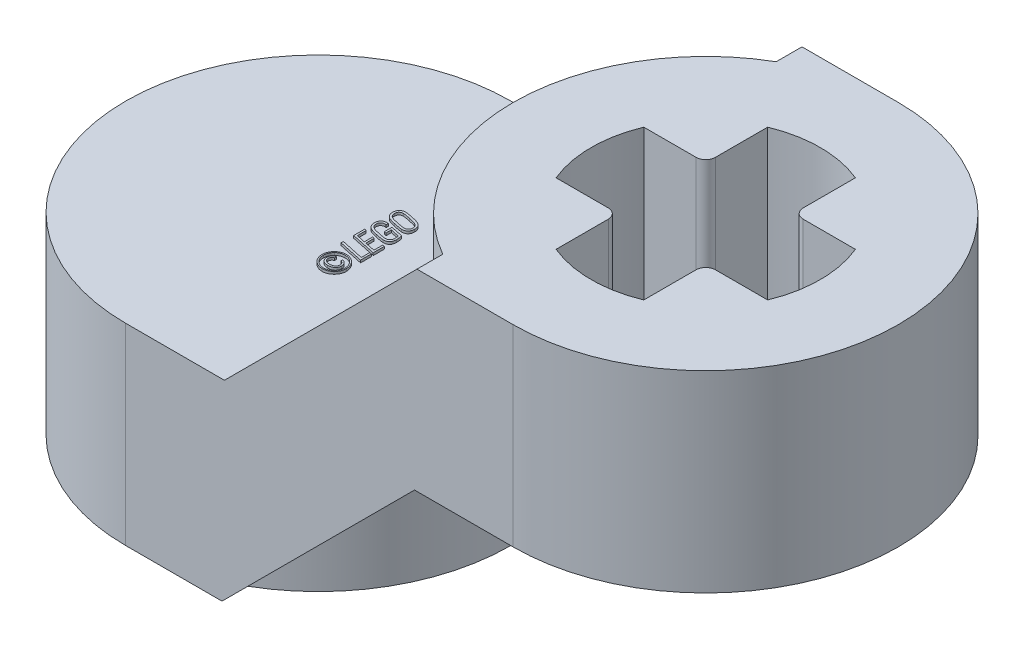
from build123d import *

# Parameters (mm, degrees)
BASE_EXTRUDE_DEPTH  = 3.95
BOSS_EXTRUDE1_DEPTH = 3.95
BOSS_EXTRUDE2_DEPTH = 3.95
BOSS_EXTRUDE4_REACH = 16.82
SKETCH6_R           = 3.95
BOSS_EXTRUDE5_DEPTH = 0.05
BOSS_EXTRUDE6_REACH = 16.82
CUT_EXTRUDE1_DEPTH  = 3.85
CUT_EXTRUDE2_DEPTH  = 3.85
FILLET1_R           = 0.2


with BuildPart() as part:
    # Sketch1 → Base-Extrude (new, symmetric)
    with BuildSketch(Plane.XY):
        Polygon((7.95, 3.95), (7.95, 7.9), (5.975, 7.9), (2.025, 3.95), (0, 3.95), (0, 0), (1.975, 0), (5.925, 3.95), align=None)
    extrude(amount=BASE_EXTRUDE_DEPTH, both=True)

    # Sketch2 → Boss-Extrude1 (add)
    with BuildSketch(Plane(origin=(0, 7.9, 0), x_dir=(-1, 0, 0), z_dir=(0, 1, 0))):
        with BuildLine():
            Line((-7.95, 3.95), (-7.95, -3.95))
            ThreePointArc((-7.95, -3.95), (-11.9, 0), (-7.95, 3.95))
        make_face()
    extrude(amount=-BOSS_EXTRUDE1_DEPTH)

    # Sketch3 → Boss-Extrude2 (add)
    with BuildSketch(Plane(origin=(0, 3.95, 0), x_dir=(-1, 0, 0), z_dir=(0, 1, 0))):
        with BuildLine():
            Line((0, 3.95), (0, -3.95))
            ThreePointArc((0, -3.95), (3.95, 0), (0, 3.95))
        make_face()
    extrude(amount=-BOSS_EXTRUDE2_DEPTH)

    # Sketch6 → Boss-Extrude4 (add, up to next)
    with BuildSketch(Plane.XZ, mode=Mode.PRIVATE) as boss_extrude4_sk1:
        Circle(SKETCH6_R)
    boss_extrude4_tool1 = extrude(boss_extrude4_sk1.sketch, amount=-BOSS_EXTRUDE4_REACH, mode=Mode.PRIVATE) - part.part
    add(boss_extrude4_tool1.solids().sort_by_distance((0, 0, 0))[0])

    # Sketch8 → Boss-Extrude5 (add)
    # profile 1 of 6: a face of its own
    with BuildSketch(Plane(origin=(3.457388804, 3.95, -0.420708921), x_dir=(0, 0, -1), z_dir=(0, 1, 0))):
        with BuildLine():
            add(Edge.make_bspline(
                [(-1.184734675, 2.616102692), (-1.176321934, 2.615850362), (-1.159629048, 2.615349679), (-1.134907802, 2.611884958), (-1.110946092, 2.605789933), (-1.08771275, 2.597576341), (-1.065439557, 2.587097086), (-1.044290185, 2.574455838), (-1.024445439, 2.559567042), (-1.01241201, 2.548157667), (-1.00635184, 2.542411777)],
                knots=[0, 0, 0, 0, 1.018957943, 2.021855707, 3.0162028, 4.009185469, 5.002380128, 5.992645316, 6.989073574, 8, 8, 8, 8], degree=3))
            add(Edge.make_bspline(
                [(-1.00635184, 2.542411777), (-1.000695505, 2.536496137), (-0.989428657, 2.52471278), (-0.974970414, 2.505055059), (-0.962403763, 2.484206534), (-0.952247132, 2.462031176), (-0.9440291, 2.438956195), (-0.938316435, 2.415066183), (-0.934554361, 2.390575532), (-0.934173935, 2.374003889), (-0.933982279, 2.365655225)],
                knots=[0, 0, 0, 0, 1.000946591, 1.993784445, 2.979555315, 3.975955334, 4.974114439, 5.972928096, 6.978776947, 8, 8, 8, 8], degree=3))
            add(Edge.make_bspline(
                [(-0.933982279, 2.365655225), (-0.934182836, 2.35720674), (-0.934578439, 2.340541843), (-0.938151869, 2.315989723), (-0.943940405, 2.292332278), (-0.95199028, 2.269576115), (-0.962264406, 2.247869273), (-0.974791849, 2.227349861), (-0.989287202, 2.207836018), (-1.000624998, 2.1961319), (-1.00635184, 2.190220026)],
                knots=[0, 0, 0, 0, 1.039328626, 2.050107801, 3.04630548, 4.032829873, 5.015822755, 5.996291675, 6.987905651, 8, 8, 8, 8], degree=3))
            add(Edge.make_bspline(
                [(-1.00635184, 2.190220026), (-1.012540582, 2.18439546), (-1.024818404, 2.172840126), (-1.04515056, 2.157919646), (-1.066521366, 2.144940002), (-1.088983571, 2.134162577), (-1.112241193, 2.125711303), (-1.136051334, 2.119740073), (-1.160249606, 2.115896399), (-1.176555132, 2.115437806), (-1.184734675, 2.115207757)],
                knots=[0, 0, 0, 0, 1.026834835, 2.037133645, 3.042569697, 4.046736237, 5.044640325, 6.02933777, 7.011432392, 8, 8, 8, 8], degree=3))
            add(Edge.make_bspline(
                [(-1.184734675, 2.115207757), (-1.192946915, 2.115446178), (-1.209278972, 2.115920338), (-1.233451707, 2.119610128), (-1.257099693, 2.125488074), (-1.28002556, 2.133865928), (-1.302150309, 2.144383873), (-1.323012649, 2.157354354), (-1.342971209, 2.172158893), (-1.355000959, 2.183681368), (-1.361084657, 2.189508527)],
                knots=[0, 0, 0, 0, 1.00281557, 1.994345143, 2.98007901, 3.975109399, 4.971043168, 5.966942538, 6.971839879, 8, 8, 8, 8], degree=3))
            add(Edge.make_bspline(
                [(-1.361084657, 2.189508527), (-1.366876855, 2.195524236), (-1.378379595, 2.207470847), (-1.393136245, 2.227304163), (-1.405891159, 2.248219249), (-1.416435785, 2.270209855), (-1.42469643, 2.293168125), (-1.430602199, 2.316794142), (-1.43413683, 2.341052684), (-1.434629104, 2.357410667), (-1.434877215, 2.365655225)],
                knots=[0, 0, 0, 0, 1.021116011, 2.02783661, 3.017680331, 4.015421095, 5.006948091, 5.998492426, 6.991223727, 8, 8, 8, 8], degree=3))
            add(Edge.make_bspline(
                [(-1.434877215, 2.365655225), (-1.434634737, 2.37386667), (-1.434151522, 2.390230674), (-1.430504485, 2.41448871), (-1.424467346, 2.438251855), (-1.416013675, 2.461387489), (-1.405339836, 2.483738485), (-1.392560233, 2.505078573), (-1.377752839, 2.525363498), (-1.366264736, 2.537644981), (-1.360474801, 2.543834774)],
                knots=[0, 0, 0, 0, 0.994980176, 1.982825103, 2.965844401, 3.962221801, 4.963259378, 5.963294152, 6.973512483, 8, 8, 8, 8], degree=3))
            add(Edge.make_bspline(
                [(-1.360474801, 2.543834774), (-1.354585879, 2.549480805), (-1.34289658, 2.560687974), (-1.323524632, 2.575252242), (-1.302899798, 2.587745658), (-1.280991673, 2.597966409), (-1.258107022, 2.60615923), (-1.234327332, 2.611914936), (-1.209781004, 2.615505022), (-1.193149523, 2.615901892), (-1.184734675, 2.616102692)],
                knots=[0, 0, 0, 0, 1.00234497, 1.989618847, 2.972647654, 3.96216877, 4.956928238, 5.956152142, 6.965896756, 8, 8, 8, 8], degree=3))
        make_face()
        with BuildLine():
            add(Edge.make_bspline(
                [(-0.960002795, 2.365451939), (-0.960188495, 2.372916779), (-0.960557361, 2.387744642), (-0.963812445, 2.409677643), (-0.969113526, 2.43101231), (-0.976450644, 2.451668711), (-0.985689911, 2.471487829), (-0.996789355, 2.490292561), (-1.009875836, 2.507886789), (-1.019835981, 2.518613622), (-1.0248508, 2.524014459)],
                knots=[0, 0, 0, 0, 1.018933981, 2.023970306, 3.020439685, 4.01699499, 5.012615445, 6.002099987, 6.994080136, 8, 8, 8, 8], degree=3))
            add(Edge.make_bspline(
                [(-1.0248508, 2.524014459), (-1.03029877, 2.529223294), (-1.041090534, 2.539541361), (-1.059111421, 2.552720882), (-1.07800116, 2.564209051), (-1.098016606, 2.573512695), (-1.118747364, 2.580998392), (-1.140207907, 2.586264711), (-1.162272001, 2.589534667), (-1.177201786, 2.589898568), (-1.184734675, 2.590082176)],
                knots=[0, 0, 0, 0, 1.017557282, 2.015657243, 3.00970618, 4.001009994, 4.993000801, 5.983500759, 6.982566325, 8, 8, 8, 8], degree=3))
            add(Edge.make_bspline(
                [(-1.184734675, 2.590082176), (-1.192199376, 2.589895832), (-1.207026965, 2.589525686), (-1.228929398, 2.5862849), (-1.25019447, 2.580968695), (-1.270721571, 2.573649), (-1.290357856, 2.564428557), (-1.308841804, 2.553240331), (-1.326278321, 2.540376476), (-1.33672497, 2.530366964), (-1.341975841, 2.525335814)],
                knots=[0, 0, 0, 0, 1.025734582, 2.03747875, 3.036079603, 4.034897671, 5.028729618, 6.012822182, 7.001171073, 8, 8, 8, 8], degree=3))
            add(Edge.make_bspline(
                [(-1.341975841, 2.525335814), (-1.347162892, 2.519733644), (-1.357435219, 2.508639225), (-1.370917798, 2.490512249), (-1.382443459, 2.471338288), (-1.391994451, 2.451211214), (-1.399500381, 2.430407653), (-1.404968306, 2.409116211), (-1.408157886, 2.387401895), (-1.408623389, 2.372780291), (-1.408856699, 2.365451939)],
                knots=[0, 0, 0, 0, 1.030362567, 2.040508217, 3.044001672, 4.046733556, 5.043824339, 6.025813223, 7.010537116, 8, 8, 8, 8], degree=3))
            add(Edge.make_bspline(
                [(-1.408856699, 2.365451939), (-1.40862645, 2.358123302), (-1.408169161, 2.343568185), (-1.404960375, 2.321956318), (-1.399493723, 2.30084785), (-1.392118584, 2.280226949), (-1.382673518, 2.260391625), (-1.371204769, 2.241641), (-1.357974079, 2.223891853), (-1.347812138, 2.213129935), (-1.342687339, 2.20770256)],
                knots=[0, 0, 0, 0, 1.001897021, 1.989828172, 2.979668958, 3.97900318, 4.979796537, 5.977647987, 6.980101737, 8, 8, 8, 8], degree=3))
            add(Edge.make_bspline(
                [(-1.342687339, 2.20770256), (-1.337257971, 2.202580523), (-1.326457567, 2.192391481), (-1.308694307, 2.179097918), (-1.289871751, 2.167630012), (-1.270067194, 2.15807094), (-1.249459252, 2.150571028), (-1.228297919, 2.145118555), (-1.206651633, 2.141921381), (-1.192063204, 2.141460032), (-1.184734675, 2.141228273)],
                knots=[0, 0, 0, 0, 1.018033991, 2.025130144, 3.021157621, 4.022120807, 5.021202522, 6.009233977, 6.999934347, 8, 8, 8, 8], degree=3))
            add(Edge.make_bspline(
                [(-1.184734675, 2.141228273), (-1.177404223, 2.141448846), (-1.162773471, 2.141889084), (-1.141053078, 2.145275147), (-1.119683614, 2.150631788), (-1.098848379, 2.158328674), (-1.0786867, 2.167927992), (-1.059476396, 2.179477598), (-1.04136013, 2.192897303), (-1.030378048, 2.20321912), (-1.0248508, 2.208414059)],
                knots=[0, 0, 0, 0, 0.988726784, 1.973386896, 2.95907585, 3.956986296, 4.965064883, 5.967811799, 6.977205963, 8, 8, 8, 8], degree=3))
            add(Edge.make_bspline(
                [(-1.0248508, 2.208414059), (-1.019743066, 2.213691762), (-1.009596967, 2.22417549), (-0.996719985, 2.24173004), (-0.98530942, 2.260071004), (-0.976274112, 2.279654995), (-0.968963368, 2.30004759), (-0.963845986, 2.321242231), (-0.96053819, 2.343121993), (-0.960182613, 2.357952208), (-0.960002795, 2.365451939)],
                knots=[0, 0, 0, 0, 1.008934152, 2.004165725, 2.987050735, 3.975046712, 4.963888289, 5.961734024, 6.969236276, 8, 8, 8, 8], degree=3))
        make_face(mode=Mode.SUBTRACT)
    # profile 2 of 6: a face of its own
    with BuildSketch(Plane(origin=(3.457388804, 3.95, -0.420708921), x_dir=(0, 0, -1), z_dir=(0, 1, 0))):
        with BuildLine():
            add(Edge.make_bspline(
                [(-1.116125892, 2.429791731), (-1.117333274, 2.434015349), (-1.119688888, 2.442255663), (-1.125630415, 2.45341847), (-1.13303663, 2.463229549), (-1.142172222, 2.47133904), (-1.152618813, 2.477947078), (-1.164403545, 2.482616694), (-1.177341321, 2.48554819), (-1.186378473, 2.485846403), (-1.191036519, 2.486000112)],
                knots=[0, 0, 0, 0, 1.034583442, 2.018481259, 2.965600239, 3.922832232, 4.88602793, 5.869340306, 6.901787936, 8, 8, 8, 8], degree=3))
            add(Edge.make_bspline(
                [(-1.191036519, 2.486000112), (-1.194397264, 2.485908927), (-1.20098528, 2.485730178), (-1.210555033, 2.484142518), (-1.219581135, 2.481745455), (-1.228042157, 2.478257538), (-1.235859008, 2.473643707), (-1.243128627, 2.468119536), (-1.249835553, 2.461617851), (-1.255867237, 2.454118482), (-1.261276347, 2.445734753), (-1.2659551, 2.436532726), (-1.269914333, 2.426523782), (-1.273157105, 2.415707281), (-1.275673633, 2.40408308), (-1.277517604, 2.391658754), (-1.278478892, 2.378409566), (-1.278660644, 2.369315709), (-1.278754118, 2.364638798)],
                knots=[0, 0, 0, 0, 0.954364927, 1.870826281, 2.749014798, 3.603666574, 4.462321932, 5.321139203, 6.192652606, 7.109872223, 8.049900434, 9.023020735, 10.038511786, 11.104546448, 12.228195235, 13.415499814, 14.67080855, 16, 16, 16, 16], degree=3))
            add(Edge.make_bspline(
                [(-1.278754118, 2.364638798), (-1.278670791, 2.36016428), (-1.278508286, 2.351438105), (-1.277398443, 2.338699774), (-1.27549472, 2.326665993), (-1.272730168, 2.315360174), (-1.269301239, 2.304730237), (-1.265061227, 2.294830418), (-1.259883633, 2.28573561), (-1.254175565, 2.277280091), (-1.247655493, 2.269781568), (-1.240610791, 2.263179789), (-1.232944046, 2.25766957), (-1.224707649, 2.253165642), (-1.215968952, 2.249551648), (-1.206584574, 2.247175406), (-1.196715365, 2.245578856), (-1.18992505, 2.245401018), (-1.1864626, 2.245310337)],
                knots=[0, 0, 0, 0, 1.263666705, 2.46439412, 3.608060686, 4.701172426, 5.748162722, 6.759612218, 7.736430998, 8.699894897, 9.636077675, 10.536616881, 11.420945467, 12.294596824, 13.183057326, 14.083596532, 15.022806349, 16, 16, 16, 16], degree=3))
            add(Edge.make_bspline(
                [(-1.1864626, 2.245310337), (-1.181365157, 2.245532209), (-1.171440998, 2.24596417), (-1.157108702, 2.24912009), (-1.143977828, 2.254638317), (-1.132085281, 2.262118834), (-1.121788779, 2.271507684), (-1.113329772, 2.282416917), (-1.106844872, 2.29480689), (-1.104374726, 2.303830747), (-1.103115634, 2.308430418)],
                knots=[0, 0, 0, 0, 1.079119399, 2.10092667, 3.088298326, 4.081569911, 5.061799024, 6.023337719, 6.992448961, 8, 8, 8, 8], degree=3))
            Line((-1.103115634, 2.308430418), (-1.070589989, 2.308430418))
            add(Edge.make_bspline(
                [(-1.070589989, 2.308430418), (-1.070993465, 2.304996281), (-1.071791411, 2.298204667), (-1.074205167, 2.288354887), (-1.077294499, 2.278906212), (-1.081517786, 2.270032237), (-1.086651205, 2.261636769), (-1.092657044, 2.253685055), (-1.099613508, 2.246235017), (-1.107440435, 2.239369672), (-1.115881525, 2.233104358), (-1.124911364, 2.227678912), (-1.134403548, 2.223088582), (-1.144406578, 2.219319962), (-1.15491743, 2.216378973), (-1.165924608, 2.214227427), (-1.177422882, 2.213017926), (-1.185240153, 2.212863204), (-1.189206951, 2.212784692)],
                knots=[0, 0, 0, 0, 0.986260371, 1.95050462, 2.889531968, 3.819800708, 4.748761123, 5.694736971, 6.65970864, 7.65334055, 8.66317646, 9.65680837, 10.656120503, 11.66933233, 12.704332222, 13.768524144, 14.867659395, 16, 16, 16, 16], degree=3))
            add(Edge.make_bspline(
                [(-1.189206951, 2.212784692), (-1.194026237, 2.212876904), (-1.203439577, 2.213057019), (-1.217123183, 2.215188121), (-1.230028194, 2.218434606), (-1.242254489, 2.22288144), (-1.253645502, 2.228833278), (-1.264330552, 2.236009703), (-1.274234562, 2.244490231), (-1.283268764, 2.254274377), (-1.291332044, 2.265152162), (-1.298578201, 2.276877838), (-1.304408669, 2.289697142), (-1.309278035, 2.303337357), (-1.313187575, 2.317874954), (-1.315864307, 2.333319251), (-1.317540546, 2.349693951), (-1.317701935, 2.360907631), (-1.317784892, 2.366671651)],
                knots=[0, 0, 0, 0, 1.021960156, 1.996158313, 2.930921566, 3.843207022, 4.750120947, 5.651545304, 6.569508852, 7.510803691, 8.471453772, 9.439502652, 10.430355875, 11.453832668, 12.510809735, 13.620872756, 14.777088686, 16, 16, 16, 16], degree=3))
            add(Edge.make_bspline(
                [(-1.317784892, 2.366671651), (-1.31765439, 2.372299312), (-1.317399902, 2.383273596), (-1.315810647, 2.399293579), (-1.312954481, 2.414421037), (-1.30896113, 2.428683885), (-1.304051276, 2.442187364), (-1.297801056, 2.454736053), (-1.290435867, 2.466411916), (-1.28200124, 2.477150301), (-1.272712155, 2.486942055), (-1.262501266, 2.495369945), (-1.251661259, 2.502587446), (-1.24006682, 2.508381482), (-1.227787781, 2.513026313), (-1.214750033, 2.516218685), (-1.201025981, 2.518220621), (-1.191653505, 2.518422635), (-1.18686917, 2.518525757)],
                knots=[0, 0, 0, 0, 1.196898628, 2.334025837, 3.419361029, 4.466545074, 5.481092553, 6.470377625, 7.441922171, 8.411995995, 9.370087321, 10.306500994, 11.221801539, 12.13374922, 13.057210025, 14.007902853, 14.983101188, 16, 16, 16, 16], degree=3))
            add(Edge.make_bspline(
                [(-1.18686917, 2.518525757), (-1.183241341, 2.518440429), (-1.176103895, 2.518272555), (-1.165628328, 2.517166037), (-1.155563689, 2.515221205), (-1.14595003, 2.512475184), (-1.136734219, 2.509046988), (-1.128017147, 2.504698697), (-1.119709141, 2.499646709), (-1.111891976, 2.493853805), (-1.104717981, 2.487490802), (-1.098245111, 2.4806528), (-1.092618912, 2.473296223), (-1.087853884, 2.46544387), (-1.083829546, 2.457197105), (-1.080821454, 2.448438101), (-1.078417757, 2.439305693), (-1.077539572, 2.432988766), (-1.077095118, 2.429791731)],
                knots=[0, 0, 0, 0, 1.121250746, 2.205965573, 3.251297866, 4.285503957, 5.292962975, 6.285785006, 7.291501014, 8.29470614, 9.288687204, 10.251738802, 11.200508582, 12.145166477, 13.086568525, 14.030471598, 15.003209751, 16, 16, 16, 16], degree=3))
            Line((-1.077095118, 2.429791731), (-1.116125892, 2.429791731))
        make_face()
    # profile 3 of 6: a face of its own
    with BuildSketch(Plane(origin=(3.457388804, 3.95, -0.420708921), x_dir=(0, 0, -1), z_dir=(0, 1, 0))):
        Polygon((-0.888446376, 2.121712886), (-0.781416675, 2.62911295), (-0.734356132, 2.62911295), (-0.834779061, 2.16074366), (-0.66076686, 2.16074366), (-0.669101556, 2.121712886), align=None)
    # profile 4 of 6: a face of its own
    with BuildSketch(Plane(origin=(3.457388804, 3.95, -0.420708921), x_dir=(0, 0, -1), z_dir=(0, 1, 0))):
        Polygon((-0.628241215, 2.121712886), (-0.522126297, 2.62911295), (-0.296479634, 2.62911295), (-0.304509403, 2.590082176), (-0.48604316, 2.590082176), (-0.525480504, 2.407938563), (-0.355025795, 2.407938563), (-0.362648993, 2.368907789), (-0.53300206, 2.368907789), (-0.575082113, 2.16074366), (-0.394056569, 2.16074366), (-0.40137484, 2.121712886), align=None)
    # profile 5 of 6: a face of its own
    with BuildSketch(Plane(origin=(3.457388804, 3.95, -0.420708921), x_dir=(0, 0, -1), z_dir=(0, 1, 0))):
        with BuildLine():
            add(Edge.make_bspline(
                [(-0.034851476, 2.130860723), (-0.040879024, 2.129657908), (-0.052615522, 2.127315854), (-0.069797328, 2.124179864), (-0.086082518, 2.121381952), (-0.101471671, 2.119166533), (-0.115939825, 2.117394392), (-0.129468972, 2.116222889), (-0.142037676, 2.115288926), (-0.150112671, 2.115234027), (-0.153976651, 2.115207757)],
                knots=[0, 0, 0, 0, 1.225832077, 2.386870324, 3.483325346, 4.521138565, 5.487527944, 6.389900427, 7.229548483, 8, 8, 8, 8], degree=3))
            add(Edge.make_bspline(
                [(-0.153976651, 2.115207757), (-0.159672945, 2.115290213), (-0.170751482, 2.11545058), (-0.186818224, 2.117121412), (-0.201809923, 2.119723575), (-0.215748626, 2.123352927), (-0.228577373, 2.12813918), (-0.240387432, 2.133908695), (-0.251020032, 2.14090356), (-0.260644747, 2.148837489), (-0.2691449, 2.157853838), (-0.276500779, 2.167896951), (-0.282757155, 2.178932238), (-0.2876928, 2.191058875), (-0.291659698, 2.204084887), (-0.294526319, 2.21813327), (-0.296092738, 2.233179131), (-0.296348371, 2.243545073), (-0.296479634, 2.24886783)],
                knots=[0, 0, 0, 0, 1.222313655, 2.377238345, 3.462882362, 4.486000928, 5.464004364, 6.397432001, 7.301091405, 8.189403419, 9.069130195, 9.953503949, 10.85555242, 11.784749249, 12.757873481, 13.774795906, 14.85739087, 16, 16, 16, 16], degree=3))
            add(Edge.make_bspline(
                [(-0.296479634, 2.24886783), (-0.296380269, 2.252867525), (-0.296163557, 2.261590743), (-0.294975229, 2.275698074), (-0.293013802, 2.29193216), (-0.29071912, 2.306780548), (-0.288652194, 2.319899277), (-0.286647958, 2.330716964), (-0.284702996, 2.342332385), (-0.282272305, 2.354601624), (-0.279903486, 2.367672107), (-0.277117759, 2.38144744), (-0.2741847, 2.395985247), (-0.272124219, 2.40590671), (-0.271068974, 2.410987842)],
                knots=[0, 0, 0, 0, 0.876487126, 1.911592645, 3.100341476, 4.458879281, 5.203351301, 6.010101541, 6.869316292, 7.783654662, 8.750433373, 9.779746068, 10.862929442, 12, 12, 12, 12], degree=3))
            add(Edge.make_bspline(
                [(-0.271068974, 2.410987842), (-0.269958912, 2.416037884), (-0.267804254, 2.425840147), (-0.264524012, 2.44013192), (-0.261379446, 2.453617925), (-0.258382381, 2.466311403), (-0.255294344, 2.478118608), (-0.252338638, 2.489127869), (-0.249528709, 2.499336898), (-0.245944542, 2.511568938), (-0.241516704, 2.525349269), (-0.236043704, 2.54020831), (-0.230672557, 2.553001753), (-0.226602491, 2.560563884), (-0.224719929, 2.56406166)],
                knots=[0, 0, 0, 0, 1.160392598, 2.252352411, 3.290740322, 4.268182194, 5.179221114, 6.029501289, 6.826431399, 7.555467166, 8.890004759, 10.073631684, 11.108980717, 12, 12, 12, 12], degree=3))
            add(Edge.make_bspline(
                [(-0.224719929, 2.56406166), (-0.220817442, 2.570343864), (-0.213208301, 2.58259302), (-0.199302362, 2.598637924), (-0.184069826, 2.612240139), (-0.167260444, 2.623286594), (-0.148786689, 2.631794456), (-0.128683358, 2.637868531), (-0.106840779, 2.641458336), (-0.091751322, 2.641896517), (-0.083944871, 2.642123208)],
                knots=[0, 0, 0, 0, 1.045860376, 2.039237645, 2.994234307, 3.929665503, 4.876250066, 5.864225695, 6.895068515, 8, 8, 8, 8], degree=3))
            add(Edge.make_bspline(
                [(-0.083944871, 2.642123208), (-0.078858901, 2.642030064), (-0.068934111, 2.641848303), (-0.054487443, 2.640308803), (-0.040888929, 2.637775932), (-0.028169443, 2.634280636), (-0.016397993, 2.629622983), (-0.005410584, 2.624197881), (0.004593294, 2.617491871), (0.013764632, 2.609899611), (0.02188694, 2.601345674), (0.029004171, 2.591987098), (0.035008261, 2.581788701), (0.039912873, 2.570737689), (0.043626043, 2.558888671), (0.046405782, 2.546279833), (0.048038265, 2.532832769), (0.048206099, 2.523578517), (0.048292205, 2.518830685)],
                knots=[0, 0, 0, 0, 1.187988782, 2.318247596, 3.389450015, 4.41694543, 5.394441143, 6.343149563, 7.273990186, 8.201324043, 9.119525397, 10.023491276, 10.942545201, 11.878052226, 12.841830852, 13.83862194, 14.891119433, 16, 16, 16, 16], degree=3))
            add(Edge.make_bspline(
                [(0.048292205, 2.518830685), (0.048234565, 2.517034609), (0.048101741, 2.512895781), (0.047604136, 2.505902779), (0.046500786, 2.497378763), (0.045684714, 2.491183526), (0.045242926, 2.487829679)],
                knots=[0, 0, 0, 0, 0.691807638, 1.594182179, 2.69758897, 4, 4, 4, 4], degree=3))
            Line((0.045242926, 2.487829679), (0.045242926, 2.486000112))
            Line((0.045242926, 2.486000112), (0.000621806, 2.486000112))
            add(Edge.make_bspline(
                [(0.000621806, 2.486000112), (0.000988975, 2.488368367), (0.001684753, 2.492856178), (0.002253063, 2.499444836), (0.002723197, 2.505644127), (0.002745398, 2.509715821), (0.002756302, 2.5117157)],
                knots=[0, 0, 0, 0, 1.112961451, 2.109046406, 3.071227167, 4, 4, 4, 4], degree=3))
            add(Edge.make_bspline(
                [(0.002756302, 2.5117157), (0.002662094, 2.515240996), (0.002478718, 2.522102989), (0.001526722, 2.532079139), (-0.000346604, 2.541422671), (-0.002867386, 2.550171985), (-0.006092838, 2.558386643), (-0.010219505, 2.565893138), (-0.014883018, 2.572920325), (-0.02039648, 2.579187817), (-0.026521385, 2.584825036), (-0.033281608, 2.589720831), (-0.040621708, 2.593931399), (-0.048631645, 2.597257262), (-0.057195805, 2.599938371), (-0.066371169, 2.601699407), (-0.076122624, 2.602861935), (-0.082823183, 2.60301395), (-0.086282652, 2.603092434)],
                knots=[0, 0, 0, 0, 1.166547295, 2.270685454, 3.310422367, 4.31425725, 5.280012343, 6.222860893, 7.143051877, 8.064607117, 8.976914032, 9.89162764, 10.820312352, 11.769601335, 12.755186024, 13.783929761, 14.855852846, 16, 16, 16, 16], degree=3))
            add(Edge.make_bspline(
                [(-0.086282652, 2.603092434), (-0.091990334, 2.602918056), (-0.103092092, 2.602578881), (-0.119050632, 2.599356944), (-0.133699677, 2.594166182), (-0.147038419, 2.586845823), (-0.159151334, 2.577260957), (-0.17012769, 2.565400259), (-0.180310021, 2.551356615), (-0.185919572, 2.540795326), (-0.188840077, 2.535296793)],
                knots=[0, 0, 0, 0, 1.048026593, 2.038469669, 2.978039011, 3.894986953, 4.821840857, 5.804264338, 6.85683226, 8, 8, 8, 8], degree=3))
            add(Edge.make_bspline(
                [(-0.188840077, 2.535296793), (-0.190272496, 2.532299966), (-0.193426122, 2.525702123), (-0.197540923, 2.514505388), (-0.201943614, 2.501363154), (-0.205482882, 2.489071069), (-0.208593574, 2.478107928), (-0.210825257, 2.468778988), (-0.213427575, 2.458706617), (-0.216075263, 2.447797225), (-0.218750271, 2.436050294), (-0.221786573, 2.423550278), (-0.224657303, 2.410202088), (-0.226711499, 2.401059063), (-0.227769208, 2.396351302)],
                knots=[0, 0, 0, 0, 0.826735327, 1.820148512, 2.967388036, 4.278160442, 5.00481677, 5.804905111, 6.666383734, 7.595406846, 8.600254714, 9.666453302, 10.798452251, 12, 12, 12, 12], degree=3))
            add(Edge.make_bspline(
                [(-0.227769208, 2.396351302), (-0.228879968, 2.390962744), (-0.231025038, 2.380556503), (-0.234229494, 2.365605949), (-0.236909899, 2.351789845), (-0.239549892, 2.339218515), (-0.241579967, 2.327733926), (-0.243612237, 2.317498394), (-0.245057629, 2.308426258), (-0.246855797, 2.29826059), (-0.248351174, 2.287032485), (-0.249848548, 2.274945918), (-0.250701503, 2.264431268), (-0.250867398, 2.257949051), (-0.250943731, 2.254966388)],
                knots=[0, 0, 0, 0, 1.380724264, 2.666417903, 3.83700122, 4.912538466, 5.889783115, 6.763609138, 7.531013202, 8.194978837, 9.354142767, 10.372930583, 11.251336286, 12, 12, 12, 12], degree=3))
            add(Edge.make_bspline(
                [(-0.250943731, 2.254966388), (-0.250870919, 2.251134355), (-0.250729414, 2.243686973), (-0.249481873, 2.232841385), (-0.247470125, 2.222633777), (-0.244626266, 2.213029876), (-0.240956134, 2.204037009), (-0.236496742, 2.195664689), (-0.231151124, 2.187975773), (-0.225042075, 2.180966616), (-0.218267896, 2.174637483), (-0.210732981, 2.1692467), (-0.202738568, 2.164534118), (-0.194064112, 2.160751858), (-0.184837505, 2.15779666), (-0.174944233, 2.155828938), (-0.164519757, 2.154425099), (-0.157335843, 2.154301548), (-0.153671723, 2.154238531)],
                knots=[0, 0, 0, 0, 1.159097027, 2.25265184, 3.298060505, 4.303502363, 5.27816348, 6.232119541, 7.167667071, 8.105010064, 9.040782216, 9.96554058, 10.902659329, 11.843582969, 12.822654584, 13.827887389, 14.892124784, 16, 16, 16, 16], degree=3))
            add(Edge.make_bspline(
                [(-0.153671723, 2.154238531), (-0.146620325, 2.154351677), (-0.132831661, 2.154572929), (-0.112551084, 2.156425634), (-0.093020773, 2.159593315), (-0.080431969, 2.162943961), (-0.074187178, 2.16460608)],
                knots=[0, 0, 0, 0, 1.052006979, 2.057148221, 3.036230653, 4, 4, 4, 4], degree=3))
            Line((-0.074187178, 2.16460608), (-0.034139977, 2.342887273))
            Line((-0.034139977, 2.342887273), (-0.146861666, 2.342887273))
            Line((-0.146861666, 2.342887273), (-0.138425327, 2.381918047))
            Line((-0.138425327, 2.381918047), (0.01576656, 2.381918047))
            Line((0.01576656, 2.381918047), (-0.018995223, 2.20770256))
            add(Edge.make_bspline(
                [(-0.018995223, 2.20770256), (-0.020197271, 2.202386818), (-0.022689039, 2.191367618), (-0.02561353, 2.17719172), (-0.028005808, 2.164876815), (-0.030027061, 2.154466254), (-0.032386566, 2.143025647), (-0.034006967, 2.135028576), (-0.034851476, 2.130860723)],
                knots=[0, 0, 0, 0, 1.25022728, 2.591642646, 3.320264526, 4.128149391, 5.0244431, 6, 6, 6, 6], degree=3))
        make_face()
    # profile 6 of 6: a face of its own
    with BuildSketch(Plane(origin=(3.457388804, 3.95, -0.420708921), x_dir=(0, 0, -1), z_dir=(0, 1, 0))):
        with BuildLine():
            add(Edge.make_bspline(
                [(0.08081785, 2.246225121), (0.080907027, 2.250394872), (0.081104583, 2.259632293), (0.08254738, 2.274720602), (0.084839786, 2.292366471), (0.087912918, 2.312560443), (0.091753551, 2.335342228), (0.096645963, 2.360578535), (0.101920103, 2.388370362), (0.10602037, 2.407641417), (0.108159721, 2.417696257)],
                knots=[0, 0, 0, 0, 0.575618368, 1.2751913, 2.090889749, 3.032200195, 4.094896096, 5.28012256, 6.580880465, 8, 8, 8, 8], degree=3))
            add(Edge.make_bspline(
                [(0.108159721, 2.417696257), (0.109933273, 2.426111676), (0.113376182, 2.442448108), (0.119308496, 2.466010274), (0.124948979, 2.488107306), (0.131058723, 2.508335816), (0.136964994, 2.526477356), (0.142567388, 2.542072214), (0.147883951, 2.554943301), (0.151752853, 2.562355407), (0.153492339, 2.565687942)],
                knots=[0, 0, 0, 0, 1.329892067, 2.581652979, 3.757237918, 4.856338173, 5.848855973, 6.707462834, 7.418866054, 8, 8, 8, 8], degree=3))
            add(Edge.make_bspline(
                [(0.153492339, 2.565687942), (0.155491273, 2.568928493), (0.159430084, 2.575313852), (0.165824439, 2.5843592), (0.172546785, 2.592677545), (0.179456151, 2.600397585), (0.186782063, 2.607272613), (0.194344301, 2.613484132), (0.202079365, 2.619169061), (0.213039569, 2.625689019), (0.227984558, 2.632447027), (0.247673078, 2.638044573), (0.269272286, 2.641576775), (0.284325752, 2.641936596), (0.292132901, 2.642123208)],
                knots=[0, 0, 0, 0, 0.82075713, 1.617264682, 2.386162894, 3.125665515, 3.849083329, 4.549605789, 5.234880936, 5.916369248, 7.29592212, 8.756850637, 10.318011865, 12, 12, 12, 12], degree=3))
            add(Edge.make_bspline(
                [(0.292132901, 2.642123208), (0.297389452, 2.642042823), (0.307590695, 2.64188682), (0.322402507, 2.640190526), (0.336296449, 2.637618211), (0.349230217, 2.633856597), (0.361213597, 2.629055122), (0.372278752, 2.623287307), (0.382332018, 2.616298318), (0.391373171, 2.608248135), (0.399485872, 2.599237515), (0.406524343, 2.589243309), (0.412405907, 2.578260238), (0.417382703, 2.566417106), (0.42090969, 2.553507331), (0.423706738, 2.539767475), (0.425339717, 2.525036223), (0.425504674, 2.514904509), (0.425589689, 2.509682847)],
                knots=[0, 0, 0, 0, 1.175277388, 2.280828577, 3.330169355, 4.332652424, 5.288203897, 6.213680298, 7.11765186, 8.019524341, 8.915743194, 9.824056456, 10.746424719, 11.697819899, 12.690920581, 13.734278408, 14.832297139, 16, 16, 16, 16], degree=3))
            add(Edge.make_bspline(
                [(0.425589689, 2.509682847), (0.425493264, 2.505818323), (0.425284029, 2.497432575), (0.424042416, 2.483808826), (0.422255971, 2.468140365), (0.420036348, 2.45372859), (0.417926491, 2.441001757), (0.416105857, 2.430253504), (0.41393786, 2.418610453), (0.411640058, 2.405992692), (0.408962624, 2.392521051), (0.406132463, 2.378111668), (0.402958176, 2.362809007), (0.400787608, 2.352272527), (0.399670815, 2.346851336)],
                knots=[0, 0, 0, 0, 0.842807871, 1.828834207, 2.981748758, 4.28162173, 5.007991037, 5.795100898, 6.658829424, 7.590630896, 8.591902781, 9.654024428, 10.792957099, 12, 12, 12, 12], degree=3))
            add(Edge.make_bspline(
                [(0.399670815, 2.346851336), (0.398485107, 2.341430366), (0.396187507, 2.330925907), (0.392841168, 2.31563637), (0.389621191, 2.301364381), (0.386439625, 2.288089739), (0.383431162, 2.275847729), (0.380462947, 2.264603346), (0.377612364, 2.254381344), (0.374203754, 2.242343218), (0.370034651, 2.228916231), (0.364716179, 2.214512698), (0.359472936, 2.202042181), (0.355411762, 2.1946641), (0.353525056, 2.191236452)],
                knots=[0, 0, 0, 0, 1.226824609, 2.37727363, 3.460296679, 4.461369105, 5.395165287, 6.247276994, 7.032354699, 7.741269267, 9.013447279, 10.139147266, 11.135500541, 12, 12, 12, 12], degree=3))
            add(Edge.make_bspline(
                [(0.353525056, 2.191236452), (0.351674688, 2.188055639), (0.348036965, 2.181802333), (0.341831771, 2.173038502), (0.335432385, 2.16482172), (0.32850393, 2.157342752), (0.321350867, 2.150435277), (0.313766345, 2.144191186), (0.305818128, 2.138581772), (0.297457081, 2.13359225), (0.288667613, 2.129185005), (0.279412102, 2.125449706), (0.269704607, 2.122270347), (0.259500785, 2.119760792), (0.248811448, 2.117742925), (0.237625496, 2.116166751), (0.225940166, 2.115413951), (0.218002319, 2.115277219), (0.21396971, 2.115207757)],
                knots=[0, 0, 0, 0, 1.052351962, 2.068866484, 3.069589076, 4.030112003, 4.98312133, 5.91277099, 6.837962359, 7.763965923, 8.696038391, 9.648307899, 10.617013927, 11.616232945, 12.652386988, 13.728578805, 14.84606553, 16, 16, 16, 16], degree=3))
            add(Edge.make_bspline(
                [(0.21396971, 2.115207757), (0.208815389, 2.115292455), (0.198784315, 2.11545729), (0.184194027, 2.117105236), (0.170524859, 2.119837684), (0.157733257, 2.123613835), (0.145775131, 2.128355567), (0.134716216, 2.134277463), (0.124618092, 2.141341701), (0.115403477, 2.149381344), (0.107266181, 2.158495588), (0.100101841, 2.168441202), (0.094214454, 2.179347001), (0.089301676, 2.191018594), (0.085426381, 2.203576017), (0.082730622, 2.217026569), (0.081063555, 2.231343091), (0.080901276, 2.241172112), (0.08081785, 2.246225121)],
                knots=[0, 0, 0, 0, 1.16414172, 2.265592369, 3.311935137, 4.309808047, 5.274966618, 6.213345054, 7.137059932, 8.05373864, 8.969777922, 9.891651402, 10.816570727, 11.763403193, 12.74883821, 13.780177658, 14.858809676, 16, 16, 16, 16], degree=3))
        make_face()
        with BuildLine():
            add(Edge.make_bspline(
                [(0.289185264, 2.603092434), (0.283377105, 2.602950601), (0.272186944, 2.60267734), (0.25625358, 2.599658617), (0.2418841, 2.594935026), (0.229010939, 2.588079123), (0.217468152, 2.578805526), (0.206845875, 2.56711637), (0.196965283, 2.552868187), (0.191385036, 2.542143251), (0.188457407, 2.536516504)],
                knots=[0, 0, 0, 0, 1.080335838, 2.08140476, 3.007134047, 3.887802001, 4.781481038, 5.750383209, 6.819757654, 8, 8, 8, 8], degree=3))
            add(Edge.make_bspline(
                [(0.188457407, 2.536516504), (0.187237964, 2.533853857), (0.184437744, 2.527739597), (0.180618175, 2.517073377), (0.176322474, 2.503896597), (0.171881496, 2.488343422), (0.167143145, 2.470790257), (0.162272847, 2.451617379), (0.157380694, 2.430950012), (0.154281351, 2.416651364), (0.152679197, 2.409259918)],
                knots=[0, 0, 0, 0, 0.530694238, 1.218638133, 2.051874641, 3.043172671, 4.150157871, 5.347821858, 6.629001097, 8, 8, 8, 8], degree=3))
            add(Edge.make_bspline(
                [(0.152679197, 2.409259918), (0.151519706, 2.403671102), (0.14927903, 2.392870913), (0.146143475, 2.377140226), (0.143158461, 2.362449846), (0.140576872, 2.348743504), (0.138058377, 2.336093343), (0.13599717, 2.324452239), (0.133993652, 2.313832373), (0.131946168, 2.301427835), (0.129722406, 2.287697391), (0.127909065, 2.273014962), (0.126681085, 2.260644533), (0.126454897, 2.253138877), (0.126353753, 2.249782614)],
                knots=[0, 0, 0, 0, 1.269945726, 2.454125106, 3.568819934, 4.605187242, 5.557279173, 6.438514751, 7.235470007, 7.961690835, 9.235746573, 10.329704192, 11.25310301, 12, 12, 12, 12], degree=3))
            add(Edge.make_bspline(
                [(0.126353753, 2.249782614), (0.126436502, 2.246120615), (0.126598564, 2.238948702), (0.127722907, 2.228515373), (0.129528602, 2.218719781), (0.132074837, 2.209552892), (0.135410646, 2.201036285), (0.139507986, 2.193136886), (0.144309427, 2.185877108), (0.149802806, 2.179238), (0.156006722, 2.17332432), (0.162899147, 2.168231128), (0.170310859, 2.163793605), (0.178451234, 2.160372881), (0.187098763, 2.157649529), (0.196331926, 2.155544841), (0.206220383, 2.154495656), (0.213019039, 2.154325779), (0.216510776, 2.154238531)],
                knots=[0, 0, 0, 0, 1.177093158, 2.305301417, 3.369110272, 4.375974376, 5.358932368, 6.303989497, 7.231370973, 8.151754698, 9.068522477, 9.979058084, 10.901823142, 11.838559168, 12.809923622, 13.814074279, 14.877325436, 16, 16, 16, 16], degree=3))
            add(Edge.make_bspline(
                [(0.216510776, 2.154238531), (0.222217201, 2.154422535), (0.233203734, 2.154776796), (0.248974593, 2.157800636), (0.263333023, 2.162621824), (0.276390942, 2.169580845), (0.288190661, 2.178885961), (0.298964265, 2.19052077), (0.308906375, 2.204462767), (0.314384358, 2.214945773), (0.317238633, 2.22040789)],
                knots=[0, 0, 0, 0, 1.066706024, 2.053720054, 2.991776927, 3.890687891, 4.807366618, 5.789382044, 6.848168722, 8, 8, 8, 8], degree=3))
            add(Edge.make_bspline(
                [(0.317238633, 2.22040789), (0.318590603, 2.223478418), (0.321558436, 2.230218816), (0.325667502, 2.241483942), (0.329778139, 2.254779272), (0.334193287, 2.270196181), (0.338884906, 2.288085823), (0.34381259, 2.308742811), (0.349206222, 2.332221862), (0.352830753, 2.348846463), (0.354744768, 2.357625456)],
                knots=[0, 0, 0, 0, 0.565071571, 1.240440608, 2.018442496, 2.909050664, 3.941793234, 5.133691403, 6.486381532, 8, 8, 8, 8], degree=3))
            add(Edge.make_bspline(
                [(0.354744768, 2.357625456), (0.355935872, 2.363146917), (0.358236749, 2.373812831), (0.361473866, 2.38923199), (0.364439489, 2.403492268), (0.367080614, 2.416604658), (0.369426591, 2.428563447), (0.371420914, 2.439384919), (0.373333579, 2.449014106), (0.375102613, 2.460076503), (0.377122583, 2.47224302), (0.378690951, 2.485337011), (0.379854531, 2.496550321), (0.379991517, 2.50341262), (0.380053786, 2.506531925)],
                knots=[0, 0, 0, 0, 1.344629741, 2.597447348, 3.750577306, 4.811939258, 5.781569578, 6.65158919, 7.431436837, 8.118277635, 9.318319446, 10.366731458, 11.257586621, 12, 12, 12, 12], degree=3))
            add(Edge.make_bspline(
                [(0.380053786, 2.506531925), (0.379957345, 2.510293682), (0.379770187, 2.517593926), (0.378850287, 2.528258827), (0.376827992, 2.538184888), (0.374394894, 2.547526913), (0.370936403, 2.556078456), (0.36704055, 2.56414959), (0.362106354, 2.571404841), (0.356611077, 2.578097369), (0.350396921, 2.584001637), (0.343494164, 2.589132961), (0.336011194, 2.593506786), (0.327829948, 2.59698193), (0.31907193, 2.599692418), (0.309666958, 2.601784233), (0.299610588, 2.602831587), (0.292710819, 2.603004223), (0.289185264, 2.603092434)],
                knots=[0, 0, 0, 0, 1.196268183, 2.321535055, 3.396668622, 4.413069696, 5.38507652, 6.324309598, 7.256289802, 8.1664195, 9.072973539, 9.973364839, 10.895145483, 11.821445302, 12.792258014, 13.806259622, 14.879071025, 16, 16, 16, 16], degree=3))
        make_face(mode=Mode.SUBTRACT)
    extrude(amount=BOSS_EXTRUDE5_DEPTH)

    # Boss-Extrude6: up to this face of the body (flat: up to its plane)
    boss_extrude6_end = Plane(part.part.faces().sort_by_distance((4, 5.925, 0))[0])
    # Sketch9 → Boss-Extrude6 (add, up to the picked face)
    with BuildSketch(Plane(origin=(0, 7.9, 0), x_dir=(1, 0, 0), z_dir=(0, 1, 0)), mode=Mode.PRIVATE) as boss_extrude6_sk1:
        with BuildLine():
            Line((5.975, 3.420800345), (5.975, -3.420800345))
            ThreePointArc((5.975, -3.420800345), (4, 0), (5.975, 3.420800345))
        make_face()
    boss_extrude6_tool1 = split(extrude(boss_extrude6_sk1.sketch, amount=-BOSS_EXTRUDE6_REACH, mode=Mode.PRIVATE), bisect_by=boss_extrude6_end, keep=Keep.BOTH, mode=Mode.PRIVATE)
    add(boss_extrude6_tool1.solids().sort_by(Axis((5.16517, 7.9, 0), (0, -1, 0)))[0])

    # Sketch10 → Cut-Extrude1 (cut)
    with BuildSketch(Plane(origin=(0, 7.9, 0), x_dir=(-1, 0, 0), z_dir=(0, 1, 0))):
        with BuildLine():
            Line((-5.779170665, -0.9), (-7.05, -0.9))
            Line((-7.05, -0.9), (-7.05, -2.170829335))
            ThreePointArc((-7.05, -2.170829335), (-7.95, -2.35), (-8.85, -2.170829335))
            Line((-8.85, -2.170829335), (-8.85, -0.9))
            Line((-8.85, -0.9), (-10.120829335, -0.9))
            ThreePointArc((-10.120829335, -0.9), (-10.3, 0), (-10.120829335, 0.9))
            Line((-10.120829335, 0.9), (-8.85, 0.9))
            Line((-8.85, 0.9), (-8.85, 2.170829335))
            ThreePointArc((-8.85, 2.170829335), (-7.95, 2.35), (-7.05, 2.170829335))
            Line((-7.05, 2.170829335), (-7.05, 0.9))
            Line((-7.05, 0.9), (-5.779170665, 0.9))
            ThreePointArc((-5.779170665, 0.9), (-5.6, 0), (-5.779170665, -0.9))
        make_face()
    extrude(amount=-CUT_EXTRUDE1_DEPTH, mode=Mode.SUBTRACT)

    # Sketch11 → Cut-Extrude2 (cut)
    with BuildSketch(Plane.XZ):
        with BuildLine():
            Line((-2.170829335, -0.9), (-0.9, -0.9))
            Line((-0.9, -0.9), (-0.9, -2.170829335))
            ThreePointArc((-0.9, -2.170829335), (0, -2.35), (0.9, -2.170829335))
            Line((0.9, -2.170829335), (0.9, -0.9))
            Line((0.9, -0.9), (2.170829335, -0.9))
            ThreePointArc((2.170829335, -0.9), (2.35, 0), (2.170829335, 0.9))
            Line((2.170829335, 0.9), (0.9, 0.9))
            Line((0.9, 0.9), (0.9, 2.170829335))
            ThreePointArc((0.9, 2.170829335), (0, 2.35), (-0.9, 2.170829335))
            Line((-0.9, 2.170829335), (-0.9, 0.9))
            Line((-0.9, 0.9), (-2.170829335, 0.9))
            ThreePointArc((-2.170829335, 0.9), (-2.35, 0), (-2.170829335, -0.9))
        make_face()
    extrude(amount=-CUT_EXTRUDE2_DEPTH, mode=Mode.SUBTRACT)

    # Fillet1
    fillet1_edges = [part.edges().sort_by_distance(p)[0] for p in [
        (8.85, 5.975, -0.9),
        (8.85, 5.975, 0.9),
        (7.05, 5.975, 0.9),
        (7.05, 5.975, -0.9),
        (-0.9, 1.925, 0.9),
        (0.9, 1.925, 0.9),
        (0.9, 1.925, -0.9),
        (-0.9, 1.925, -0.9),
    ]]
    fillet(fillet1_edges, radius=FILLET1_R)


solid = part.part
